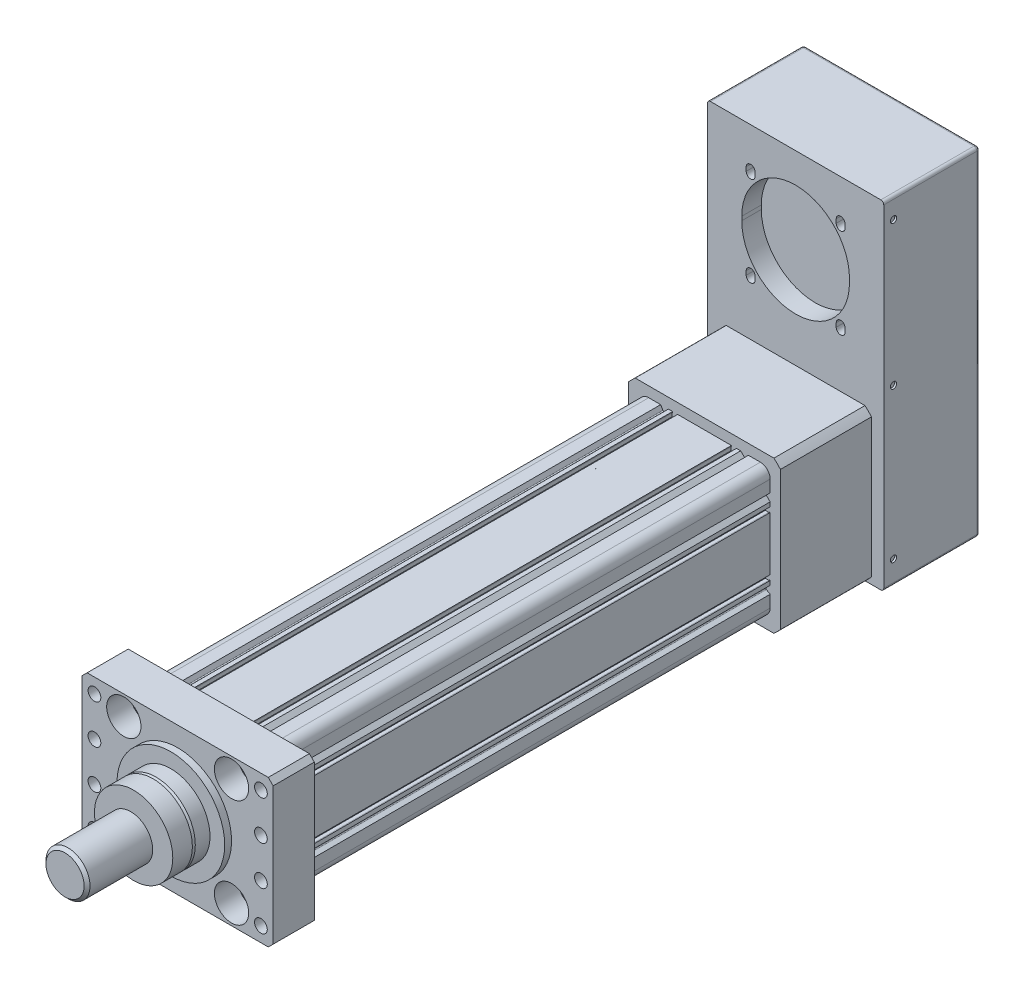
from build123d import *

# Parameters (mm, degrees)
SKETCH_1_R          = 6
EXTRUDE_1_DEPTH     = 496
EXTRUDE_1_2_DEPTH   = 42
SKETCH_3_R          = 6.5
SKETCH_3_R_2        = 8.5
CUT_EXTRUDE_1_DEPTH = 42
SKETCH_3_3_R        = 17.5
SKETCH_3_3_R_2      = 8.5
CUT_EXTRUDE_2_DEPTH = 24
SKETCH_3_4_R        = 55
EXTRUDE_2_DEPTH     = 7
SKETCH_4_R          = 40
EXTRUDE_3_DEPTH     = 18
CHAMFER_1_SIZE      = 3
CHAMFER_1_SIZE2     = 1.091910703
SKETCH_5_R          = 40
EXTRUDE_4_DEPTH     = 20
SKETCH_6_R          = 16.5
EXTRUDE_5_DEPTH     = 3
SKETCH_7_R          = 22.5
EXTRUDE_6_DEPTH     = 67
FILLET_1_R          = 1
CHAMFER_2_SIZE      = 3
EXTRUDE_7_DEPTH     = 93
SKETCH_12_W         = 180
SKETCH_12_H         = 345
EXTRUDE_9_DEPTH     = 98
CUT_EXTRUDE_5_DEPTH = 20
CUT_EXTRUDE_6_DEPTH = 20
SKETCH_15_R         = 3.25
CUT_EXTRUDE_7_DEPTH = 2
CUT_EXTRUDE_START   = -2
SKETCH_14_R         = 3.25
CUT_EXTRUDE_8_DEPTH = 2
FILLET_2_R          = 3
SKETCH_16_R         = 10
CUT_EXTRUDE_9_DEPTH = 12


with BuildPart() as part:
    # Sketch 1 → Extrude 1 (new body)
    with BuildSketch(Plane.XY):
        with BuildLine():
            Line((57, 67), (44.8, 67))
            Line((44.8, 67), (42.56486134, 63.12862628))
            ThreePointArc((42.56486134, 63.12862628), (41.829362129, 62.637181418), (40.991729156, 62.921519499))
            Line((40.991729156, 62.921519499), (36.913248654, 67))
            Line((36.913248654, 67), (32.6, 67))
            Line((32.6, 67), (32.6, 66.1))
            Line((32.6, 66.1), (33.2, 65.5))
            Line((33.2, 65.5), (33.2, 62))
            Line((33.2, 62), (26.9, 62))
            Line((26.9, 62), (26.9, 65.5))
            Line((26.9, 65.5), (27.5, 66.1))
            Line((27.5, 66.1), (27.5, 67))
            Line((27.5, 67), (0, 67))
            Line((0, 67), (-27.5, 67))
            Line((-27.5, 67), (-27.5, 66.1))
            Line((-27.5, 66.1), (-26.9, 65.5))
            Line((-26.9, 65.5), (-26.9, 62))
            Line((-26.9, 62), (-33.2, 62))
            Line((-33.2, 62), (-33.2, 65.5))
            Line((-33.2, 65.5), (-32.6, 66.1))
            Line((-32.6, 66.1), (-32.6, 67))
            Line((-32.6, 67), (-36.913248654, 67))
            Line((-36.913248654, 67), (-40.991729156, 62.921519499))
            ThreePointArc((-40.991729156, 62.921519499), (-41.829362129, 62.637181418), (-42.56486134, 63.12862628))
            Line((-42.56486134, 63.12862628), (-44.8, 67))
            Line((-44.8, 67), (-57, 67))
            ThreePointArc((-57, 67), (-64.071067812, 64.071067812), (-67, 57))
            Line((-67, 57), (-67, 44.8))
            Line((-67, 44.8), (-63.12862628, 42.56486134))
            ThreePointArc((-63.12862628, 42.56486134), (-62.637181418, 41.829362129), (-62.921519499, 40.991729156))
            Line((-62.921519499, 40.991729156), (-67, 36.913248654))
            Line((-67, 36.913248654), (-67, 32.6))
            Line((-67, 32.6), (-66.1, 32.6))
            Line((-66.1, 32.6), (-65.5, 33.2))
            Line((-65.5, 33.2), (-62, 33.2))
            Line((-62, 33.2), (-62, 26.9))
            Line((-62, 26.9), (-65.5, 26.9))
            Line((-65.5, 26.9), (-66.1, 27.5))
            Line((-66.1, 27.5), (-67, 27.5))
            Line((-67, 27.5), (-67, 0))
            Line((-67, 0), (-67, -27.5))
            Line((-67, -27.5), (-66.1, -27.5))
            Line((-66.1, -27.5), (-65.5, -26.9))
            Line((-65.5, -26.9), (-62, -26.9))
            Line((-62, -26.9), (-62, -33.2))
            Line((-62, -33.2), (-65.5, -33.2))
            Line((-65.5, -33.2), (-66.1, -32.6))
            Line((-66.1, -32.6), (-67, -32.6))
            Line((-67, -32.6), (-67, -36.913248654))
            Line((-67, -36.913248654), (-62.921519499, -40.991729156))
            ThreePointArc((-62.921519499, -40.991729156), (-62.637181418, -41.829362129), (-63.12862628, -42.56486134))
            Line((-63.12862628, -42.56486134), (-67, -44.8))
            Line((-67, -44.8), (-67, -57))
            ThreePointArc((-67, -57), (-64.071067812, -64.071067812), (-57, -67))
            Line((-57, -67), (-44.8, -67))
            Line((-44.8, -67), (-42.56486134, -63.12862628))
            ThreePointArc((-42.56486134, -63.12862628), (-41.829362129, -62.637181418), (-40.991729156, -62.921519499))
            Line((-40.991729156, -62.921519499), (-36.913248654, -67))
            Line((-36.913248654, -67), (36.913248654, -67))
            Line((36.913248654, -67), (40.991729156, -62.921519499))
            ThreePointArc((40.991729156, -62.921519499), (41.829362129, -62.637181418), (42.56486134, -63.12862628))
            Line((42.56486134, -63.12862628), (44.8, -67))
            Line((44.8, -67), (57, -67))
            ThreePointArc((57, -67), (64.071067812, -64.071067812), (67, -57))
            Line((67, -57), (67, -44.8))
            Line((67, -44.8), (63.12862628, -42.56486134))
            ThreePointArc((63.12862628, -42.56486134), (62.637181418, -41.829362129), (62.921519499, -40.991729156))
            Line((62.921519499, -40.991729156), (67, -36.913248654))
            Line((67, -36.913248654), (67, -32.6))
            Line((67, -32.6), (66.1, -32.6))
            Line((66.1, -32.6), (65.5, -33.2))
            Line((65.5, -33.2), (62, -33.2))
            Line((62, -33.2), (62, -26.9))
            Line((62, -26.9), (65.5, -26.9))
            Line((65.5, -26.9), (66.1, -27.5))
            Line((66.1, -27.5), (67, -27.5))
            Line((67, -27.5), (67, 0))
            Line((67, 0), (67, 27.5))
            Line((67, 27.5), (66.1, 27.5))
            Line((66.1, 27.5), (65.5, 26.9))
            Line((65.5, 26.9), (62, 26.9))
            Line((62, 26.9), (62, 33.2))
            Line((62, 33.2), (65.5, 33.2))
            Line((65.5, 33.2), (66.1, 32.6))
            Line((66.1, 32.6), (67, 32.6))
            Line((67, 32.6), (67, 36.913248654))
            Line((67, 36.913248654), (62.921519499, 40.991729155))
            ThreePointArc((62.921519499, 40.991729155), (62.637181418, 41.829362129), (63.12862628, 42.56486134))
            Line((63.12862628, 42.56486134), (67, 44.8))
            Line((67, 44.8), (67, 57))
            ThreePointArc((67, 57), (64.071067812, 64.071067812), (57, 67))
        make_face()
        with Locations((-55, 55)):
            Circle(SKETCH_1_R, mode=Mode.SUBTRACT)
        with Locations((55, 55)):
            Circle(SKETCH_1_R, mode=Mode.SUBTRACT)
        with Locations((-55, -55)):
            Circle(SKETCH_1_R, mode=Mode.SUBTRACT)
        with Locations((55, -55)):
            Circle(SKETCH_1_R, mode=Mode.SUBTRACT)
        with BuildLine():
            Line((41.774779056, 51.785063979), (43.601329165, 54.94874157))
            ThreePointArc((43.601329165, 54.94874157), (43.701229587, 55.707560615), (43.235303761, 56.314766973))
            Line((43.235303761, 56.314766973), (39.616756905, 58.403935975))
            ThreePointArc((39.616756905, 58.403935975), (39.337726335, 58.513191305), (39.038853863, 58.534871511))
            Line((39.038853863, 58.534871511), (35.747329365, 58.277670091))
            ThreePointArc((35.747329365, 58.277670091), (35.481311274, 58.1068038), (35.28193171, 57.86142918))
            Line((35.28193171, 57.86142918), (34.274000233, 56.115640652))
            ThreePointArc((34.274000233, 56.115640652), (34.174099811, 55.356821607), (34.640025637, 54.749615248))
            Line((34.640025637, 54.749615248), (40.408753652, 51.419038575))
            ThreePointArc((40.408753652, 51.419038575), (41.167572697, 51.319138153), (41.774779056, 51.785063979))
        make_face(mode=Mode.SUBTRACT)
        with BuildLine():
            Line((51.785063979, 41.774779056), (54.94874157, 43.601329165))
            ThreePointArc((54.94874157, 43.601329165), (55.707560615, 43.701229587), (56.314766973, 43.235303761))
            Line((56.314766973, 43.235303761), (58.403935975, 39.616756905))
            ThreePointArc((58.403935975, 39.616756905), (58.513191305, 39.337726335), (58.534871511, 39.038853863))
            Line((58.534871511, 39.038853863), (58.277670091, 35.747329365))
            ThreePointArc((58.277670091, 35.747329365), (58.1068038, 35.481311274), (57.86142918, 35.28193171))
            Line((57.86142918, 35.28193171), (56.115640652, 34.274000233))
            ThreePointArc((56.115640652, 34.274000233), (55.356821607, 34.174099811), (54.749615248, 34.640025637))
            Line((54.749615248, 34.640025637), (51.419038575, 40.408753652))
            ThreePointArc((51.419038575, 40.408753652), (51.319138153, 41.167572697), (51.785063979, 41.774779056))
        make_face(mode=Mode.SUBTRACT)
        with BuildLine():
            Line((-57.86142918, 35.28193171), (-56.115640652, 34.274000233))
            ThreePointArc((-56.115640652, 34.274000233), (-55.356821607, 34.174099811), (-54.749615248, 34.640025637))
            Line((-54.749615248, 34.640025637), (-51.419038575, 40.408753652))
            ThreePointArc((-51.419038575, 40.408753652), (-51.319138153, 41.167572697), (-51.785063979, 41.774779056))
            Line((-51.785063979, 41.774779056), (-54.94874157, 43.601329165))
            ThreePointArc((-54.94874157, 43.601329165), (-55.707560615, 43.701229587), (-56.314766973, 43.235303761))
            Line((-56.314766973, 43.235303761), (-58.403935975, 39.616756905))
            ThreePointArc((-58.403935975, 39.616756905), (-58.513191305, 39.337726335), (-58.534871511, 39.038853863))
            Line((-58.534871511, 39.038853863), (-58.277670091, 35.747329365))
            ThreePointArc((-58.277670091, 35.747329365), (-58.1068038, 35.481311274), (-57.86142918, 35.28193171))
        make_face(mode=Mode.SUBTRACT)
        with BuildLine():
            Line((-33.360371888, -64.600232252), (-19.423193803, -64.600232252))
            ThreePointArc((-19.423193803, -64.600232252), (-18.434155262, -63.747889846), (-19.1311157, -62.643837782))
            ThreePointArc((-19.1311157, -62.643837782), (-26.690004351, -59.815496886), (-33.843674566, -56.079012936))
            ThreePointArc((-33.843674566, -56.079012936), (-34.851952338, -56.064348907), (-35.360371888, -56.935181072))
            Line((-35.360371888, -56.935181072), (-35.360371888, -62.600232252))
            Line((-35.360371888, -62.600232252), (-33.360371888, -64.600232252))
        make_face(mode=Mode.SUBTRACT)
        with BuildLine():
            Line((35.360371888, -62.600232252), (33.360371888, -64.600232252))
            Line((33.360371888, -64.600232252), (19.423193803, -64.600232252))
            ThreePointArc((19.423193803, -64.600232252), (18.434155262, -63.747889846), (19.1311157, -62.643837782))
            ThreePointArc((19.1311157, -62.643837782), (26.690004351, -59.815496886), (33.843674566, -56.079012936))
            ThreePointArc((33.843674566, -56.079012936), (34.851952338, -56.064348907), (35.360371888, -56.935181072))
            Line((35.360371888, -56.935181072), (35.360371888, -62.600232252))
        make_face(mode=Mode.SUBTRACT)
        with BuildLine():
            Line((51.785063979, -41.774779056), (54.94874157, -43.601329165))
            ThreePointArc((54.94874157, -43.601329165), (55.707560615, -43.701229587), (56.314766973, -43.235303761))
            Line((56.314766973, -43.235303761), (58.403935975, -39.616756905))
            ThreePointArc((58.403935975, -39.616756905), (58.513191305, -39.337726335), (58.534871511, -39.038853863))
            Line((58.534871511, -39.038853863), (58.277670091, -35.747329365))
            ThreePointArc((58.277670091, -35.747329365), (58.1068038, -35.481311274), (57.86142918, -35.28193171))
            Line((57.86142918, -35.28193171), (56.115640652, -34.274000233))
            ThreePointArc((56.115640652, -34.274000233), (55.356821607, -34.174099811), (54.749615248, -34.640025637))
            Line((54.749615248, -34.640025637), (51.419038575, -40.408753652))
            ThreePointArc((51.419038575, -40.408753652), (51.319138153, -41.167572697), (51.785063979, -41.774779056))
        make_face(mode=Mode.SUBTRACT)
        with BuildLine():
            Line((-57.86142918, -35.28193171), (-56.115640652, -34.274000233))
            ThreePointArc((-56.115640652, -34.274000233), (-55.356821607, -34.174099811), (-54.749615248, -34.640025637))
            Line((-54.749615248, -34.640025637), (-51.419038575, -40.408753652))
            ThreePointArc((-51.419038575, -40.408753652), (-51.319138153, -41.167572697), (-51.785063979, -41.774779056))
            Line((-51.785063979, -41.774779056), (-54.94874157, -43.601329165))
            ThreePointArc((-54.94874157, -43.601329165), (-55.707560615, -43.701229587), (-56.314766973, -43.235303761))
            Line((-56.314766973, -43.235303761), (-58.403935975, -39.616756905))
            ThreePointArc((-58.403935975, -39.616756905), (-58.513191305, -39.337726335), (-58.534871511, -39.038853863))
            Line((-58.534871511, -39.038853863), (-58.277670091, -35.747329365))
            ThreePointArc((-58.277670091, -35.747329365), (-58.1068038, -35.481311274), (-57.86142918, -35.28193171))
        make_face(mode=Mode.SUBTRACT)
        with BuildLine():
            Line((-41.774779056, 51.785063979), (-43.601329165, 54.94874157))
            ThreePointArc((-43.601329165, 54.94874157), (-43.701229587, 55.707560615), (-43.235303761, 56.314766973))
            Line((-43.235303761, 56.314766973), (-39.616756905, 58.403935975))
            ThreePointArc((-39.616756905, 58.403935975), (-39.337726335, 58.513191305), (-39.038853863, 58.534871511))
            Line((-39.038853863, 58.534871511), (-35.747329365, 58.277670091))
            ThreePointArc((-35.747329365, 58.277670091), (-35.481311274, 58.1068038), (-35.28193171, 57.86142918))
            Line((-35.28193171, 57.86142918), (-34.274000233, 56.115640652))
            ThreePointArc((-34.274000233, 56.115640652), (-34.174099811, 55.356821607), (-34.640025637, 54.749615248))
            Line((-34.640025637, 54.749615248), (-40.408753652, 51.419038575))
            ThreePointArc((-40.408753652, 51.419038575), (-41.167572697, 51.319138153), (-41.774779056, 51.785063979))
        make_face(mode=Mode.SUBTRACT)
        with BuildLine():
            ThreePointArc((62.5, 0), (0, 62.5), (-62.5, 0))
            ThreePointArc((-62.5, 0), (0, -62.5), (62.5, 0))
        make_face(mode=Mode.SUBTRACT)
    extrude(amount=EXTRUDE_1_DEPTH)

    # Sketch 2 → Extrude 1 2 (add)
    with BuildSketch(Plane.XY.offset(496)):
        Polygon((-97.5, 70), (-92.5, 75), (92.5, 75), (97.5, 70), (97.5, -70), (92.5, -75), (-92.5, -75), (-97.5, -70), align=None)
    extrude(amount=EXTRUDE_1_2_DEPTH)

    # Sketch 3 → Cut-Extrude 1 (cut)
    with BuildSketch(Plane.XY.offset(538)):
        with Locations((-85, 20)):
            Circle(SKETCH_3_R)
        with Locations((-85, -20)):
            Circle(SKETCH_3_R)
        with Locations((-85, -60)):
            Circle(SKETCH_3_R)
        with Locations((-55, -55)):
            Circle(SKETCH_3_R_2)
        with Locations((-55, 55)):
            Circle(SKETCH_3_R_2)
        with Locations((55, 55)):
            Circle(SKETCH_3_R_2)
        with Locations((85, 60)):
            Circle(SKETCH_3_R)
        with Locations((85, 20)):
            Circle(SKETCH_3_R)
        with Locations((85, -20)):
            Circle(SKETCH_3_R)
        with Locations((85, -60)):
            Circle(SKETCH_3_R)
        with Locations((55, -55)):
            Circle(SKETCH_3_R_2)
        with Locations((-85, 60)):
            Circle(SKETCH_3_R)
    extrude(amount=-CUT_EXTRUDE_1_DEPTH, mode=Mode.SUBTRACT)

    # Sketch 3_3 → Cut-Extrude 2 (cut)
    # profile 1 of 4: a face of its own
    with BuildSketch(Plane.XY.offset(538)):
        with Locations((55, 55)):
            Circle(SKETCH_3_3_R)
        with Locations((55, 55)):
            Circle(SKETCH_3_3_R_2, mode=Mode.SUBTRACT)
    # profile 2 of 4: a face of its own
    with BuildSketch(Plane.XY.offset(538)):
        with Locations((55, -55)):
            Circle(SKETCH_3_3_R)
        with Locations((55, -55)):
            Circle(SKETCH_3_3_R_2, mode=Mode.SUBTRACT)
    # profile 3 of 4: a face of its own
    with BuildSketch(Plane.XY.offset(538)):
        with Locations((-55, -55)):
            Circle(SKETCH_3_3_R)
        with Locations((-55, -55)):
            Circle(SKETCH_3_3_R_2, mode=Mode.SUBTRACT)
    # profile 4 of 4: a face of its own
    with BuildSketch(Plane.XY.offset(538)):
        with Locations((-55, 55)):
            Circle(SKETCH_3_3_R)
    extrude(amount=-CUT_EXTRUDE_2_DEPTH, mode=Mode.SUBTRACT)

    # Sketch 3_4 → Extrude 2 (add)
    with BuildSketch(Plane.XY.offset(538)):
        with Locations(Location((0, 0, 0), (0, 0, 180))):
            Circle(SKETCH_3_4_R)
    extrude(amount=EXTRUDE_2_DEPTH)

    # Sketch 4 → Extrude 3 (add)
    with BuildSketch(Plane.XY.offset(545)):
        Circle(SKETCH_4_R)
    extrude(amount=EXTRUDE_3_DEPTH)

    # Chamfer 1
    chamfer_1_edges = [part.edges().sort_by_distance(p)[0] for p in [
        (-40, 0, 563),
    ]]
    chamfer_1_side = [part.faces().sort_by_distance(p)[0] for p in [
        (-40, 0, 554),
    ]]
    chamfer(chamfer_1_edges, length=CHAMFER_1_SIZE, length2=CHAMFER_1_SIZE2, reference=chamfer_1_side[0])

    # Sketch 5 → Extrude 4 (add)
    with BuildSketch(Plane.XY.offset(563)):
        Circle(SKETCH_5_R)
    extrude(amount=EXTRUDE_4_DEPTH)

    # Sketch 6 → Extrude 5 (add)
    with BuildSketch(Plane.XY.offset(583)):
        Circle(SKETCH_6_R)
    extrude(amount=EXTRUDE_5_DEPTH)

    # Sketch 7 → Extrude 6 (add)
    with BuildSketch(Plane.XY.offset(586)):
        Circle(SKETCH_7_R)
    extrude(amount=EXTRUDE_6_DEPTH)

    # Fillet 1
    fillet_1_edges = [part.edges().sort_by_distance(p)[0] for p in [
        (-16.5, 0, 583),
    ]]
    fillet(fillet_1_edges, radius=FILLET_1_R)

    # Chamfer 2
    chamfer_2_edges = [part.edges().sort_by_distance(p)[0] for p in [
        (-22.5, 0, 653),
    ]]
    chamfer(chamfer_2_edges, length=CHAMFER_2_SIZE)

    # Sketch 8 → Extrude 7 (add)
    with BuildSketch(Plane(origin=(0, 0, 0), x_dir=(-1, 0, 0), z_dir=(0, 0, -1))):
        with BuildLine():
            Line((-70.843136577, 77.5), (70.843136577, 77.5))
            ThreePointArc((70.843136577, 77.5), (74.246212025, 74.246212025), (77.5, 70.843136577))
            Line((77.5, 70.843136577), (77.5, -70.843136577))
            ThreePointArc((77.5, -70.843136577), (74.246212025, -74.246212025), (70.843136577, -77.5))
            Line((70.843136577, -77.5), (-70.843136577, -77.5))
            ThreePointArc((-70.843136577, -77.5), (-74.246212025, -74.246212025), (-77.5, -70.843136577))
            Line((-77.5, -70.843136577), (-77.5, 70.843136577))
            ThreePointArc((-77.5, 70.843136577), (-74.246212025, 74.246212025), (-70.843136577, 77.5))
        make_face()
    extrude(amount=EXTRUDE_7_DEPTH)

    # Sketch 12 → Extrude 9 (add)
    with BuildSketch(Plane(origin=(0, 0, -93), x_dir=(-1, 0, 0), z_dir=(0, 0, -1))):
        with Locations((0, 95)):
            Rectangle(SKETCH_12_W, SKETCH_12_H)
    extrude(amount=EXTRUDE_9_DEPTH)

    # Sketch 13 → Cut-Extrude 5 (cut)
    with BuildSketch(Plane.XY.offset(-93)):
        with BuildLine():
            Line((-55, 182), (-55, 178))
            ThreePointArc((-55, 178), (0, 123), (55, 178))
            Line((55, 178), (55, 182))
            ThreePointArc((55, 182), (0, 237), (-55, 182))
        make_face()
    extrude(amount=-CUT_EXTRUDE_5_DEPTH, mode=Mode.SUBTRACT)

    # Sketch 13_3 → Cut-Extrude 6 (cut)
    with BuildSketch(Plane.XY.offset(-93)):
        with BuildLine():
            Line((-50.461940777, 223.961940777), (-50.461940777, 227.961940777))
            ThreePointArc((-50.461940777, 227.961940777), (-45.961940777, 232.461940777), (-41.461940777, 227.961940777))
            Line((-41.461940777, 227.961940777), (-41.461940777, 223.961940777))
            ThreePointArc((-41.461940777, 223.961940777), (-45.961940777, 219.461940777), (-50.461940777, 223.961940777))
        make_face()
        with BuildLine():
            Line((50.461940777, 223.961940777), (50.461940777, 227.961940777))
            ThreePointArc((50.461940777, 227.961940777), (45.961940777, 232.461940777), (41.461940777, 227.961940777))
            Line((41.461940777, 227.961940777), (41.461940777, 223.961940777))
            ThreePointArc((41.461940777, 223.961940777), (45.961940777, 219.461940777), (50.461940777, 223.961940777))
        make_face()
        with BuildLine():
            Line((50.461940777, 136.038059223), (50.461940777, 132.038059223))
            ThreePointArc((50.461940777, 132.038059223), (45.961940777, 127.538059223), (41.461940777, 132.038059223))
            Line((41.461940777, 132.038059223), (41.461940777, 136.038059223))
            ThreePointArc((41.461940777, 136.038059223), (45.961940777, 140.538059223), (50.461940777, 136.038059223))
        make_face()
        with BuildLine():
            Line((-50.461940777, 136.038059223), (-50.461940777, 132.038059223))
            ThreePointArc((-50.461940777, 132.038059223), (-45.961940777, 127.538059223), (-41.461940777, 132.038059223))
            Line((-41.461940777, 132.038059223), (-41.461940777, 136.038059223))
            ThreePointArc((-41.461940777, 136.038059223), (-45.961940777, 140.538059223), (-50.461940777, 136.038059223))
        make_face()
    extrude(amount=-CUT_EXTRUDE_6_DEPTH, mode=Mode.SUBTRACT)

    # Sketch 15 → Cut-Extrude 7 (cut)
    with BuildSketch(Plane(origin=(90, 0, 0), x_dir=(0, 0, -1), z_dir=(1, 0, 0))):
        with Locations(Location((103, 246.5, 0), (0, 0, 90))):
            Circle(SKETCH_15_R)
        with Locations(Location((103, 100, 0), (0, 0, 90))):
            Circle(SKETCH_15_R)
        with Locations(Location((103, -53.5, 0), (0, 0, 90))):
            Circle(SKETCH_15_R)
    extrude(amount=-CUT_EXTRUDE_7_DEPTH, mode=Mode.SUBTRACT)

    # Sketch 14 → Cut-Extrude 8 (cut)
    with BuildSketch(Plane.ZY.offset(90).offset(CUT_EXTRUDE_START)):
        with Locations(Location((-103, -53.5, 0), (0, 0, 90))):
            Circle(SKETCH_14_R)
        with Locations(Location((-103, 100, 0), (0, 0, 90))):
            Circle(SKETCH_14_R)
        with Locations(Location((-103, 246.5, 0), (0, 0, 90))):
            Circle(SKETCH_14_R)
    extrude(amount=CUT_EXTRUDE_8_DEPTH, mode=Mode.SUBTRACT)

    # Fillet 2
    fillet_2_edges = [part.edges().sort_by_distance(p)[0] for p in [
        (-90, -77.5, -142),
        (-90, 267.5, -142),
        (90, 267.5, -142),
        (90, -77.5, -142),
        (-90, 95, -191),
        (0, 267.5, -191),
        (90, 95, -191),
        (0, -77.5, -191),
    ]]
    fillet(fillet_2_edges, radius=FILLET_2_R)

    # Sketch 16 → Cut-Extrude 9 (cut)
    with BuildSketch(Plane(origin=(0, 0, 496), x_dir=(-1, 0, 0), z_dir=(0, 0, -1))):
        with Locations((-85, -60)):
            Circle(SKETCH_16_R)
        with Locations((85, -60)):
            Circle(SKETCH_16_R)
        with Locations((85, -20)):
            Circle(SKETCH_16_R)
        with Locations((85, 20)):
            Circle(SKETCH_16_R)
        with Locations((85, 60)):
            Circle(SKETCH_16_R)
        with Locations((-85, -20)):
            Circle(SKETCH_16_R)
        with Locations((-85, 20)):
            Circle(SKETCH_16_R)
        with Locations((-85, 60)):
            Circle(SKETCH_16_R)
    extrude(amount=-CUT_EXTRUDE_9_DEPTH, mode=Mode.SUBTRACT)


solid = part.part
